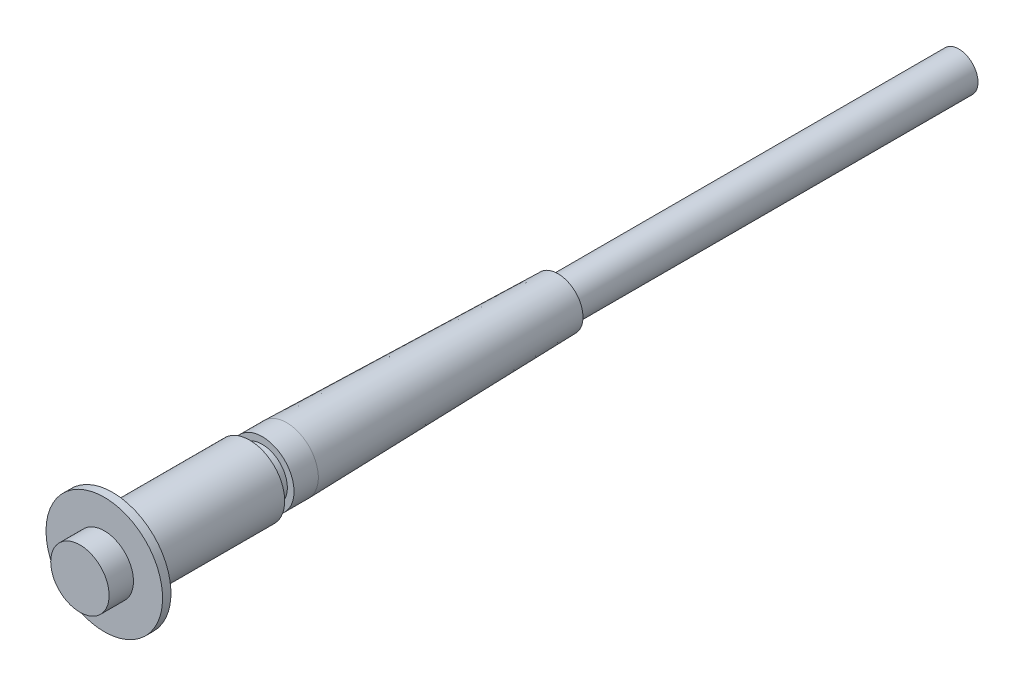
ISO-10303-21;
HEADER;
FILE_DESCRIPTION(('STEP AP214'),'2;1');
FILE_NAME('part.step','',(''),(''),'','','');
FILE_SCHEMA(('AUTOMOTIVE_DESIGN { 1 0 10303 214 1 1 1 1 }'));
ENDSEC;
DATA;
#1=APPLICATION_CONTEXT('core data for automotive mechanical design processes');
#2=APPLICATION_PROTOCOL_DEFINITION('international standard','automotive_design',2000,#1);
#3=PRODUCT_CONTEXT('',#1,'mechanical');
#4=PRODUCT('Part','Part','',(#3));
#5=PRODUCT_RELATED_PRODUCT_CATEGORY('part','',(#4));
#6=PRODUCT_DEFINITION_FORMATION('','',#4);
#7=PRODUCT_DEFINITION_CONTEXT('part definition',#1,'design');
#8=PRODUCT_DEFINITION('design','',#6,#7);
#9=PRODUCT_DEFINITION_SHAPE('','',#8);
#10=(LENGTH_UNIT() NAMED_UNIT(*) SI_UNIT(.MILLI.,.METRE.));
#11=(NAMED_UNIT(*) PLANE_ANGLE_UNIT() SI_UNIT($,.RADIAN.));
#12=(NAMED_UNIT(*) SI_UNIT($,.STERADIAN.) SOLID_ANGLE_UNIT());
#13=UNCERTAINTY_MEASURE_WITH_UNIT(LENGTH_MEASURE(1.E-05),#10,'distance_accuracy_value','');
#14=(GEOMETRIC_REPRESENTATION_CONTEXT(3) GLOBAL_UNCERTAINTY_ASSIGNED_CONTEXT((#13)) GLOBAL_UNIT_ASSIGNED_CONTEXT((#10,
#11,#12)) REPRESENTATION_CONTEXT('',''));
#15=CARTESIAN_POINT('',(0.,0.,0.));
#16=DIRECTION('',(0.,0.,1.));
#17=DIRECTION('',(1.,0.,0.));
#18=AXIS2_PLACEMENT_3D('',#15,#16,#17);
#19=CARTESIAN_POINT('',(-19.05,0.,-344.932));
#20=DIRECTION('',(0.,0.,-1.));
#21=DIRECTION('',(-1.,0.,0.));
#22=AXIS2_PLACEMENT_3D('',#19,#20,#21);
#23=PLANE('',#22);
#24=CARTESIAN_POINT('',(0.,0.,-344.932));
#25=DIRECTION('',(0.,0.,-1.));
#26=DIRECTION('',(-1.,0.,0.));
#27=AXIS2_PLACEMENT_3D('',#24,#25,#26);
#28=CIRCLE('',#27,19.05);
#29=CARTESIAN_POINT('',(-19.05,0.,-344.932));
#30=VERTEX_POINT('',#29);
#31=EDGE_CURVE('E63',#30,#30,#28,.T.);
#32=ORIENTED_EDGE('',*,*,#31,.T.);
#33=EDGE_LOOP('',(#32));
#34=FACE_BOUND('',#33,.T.);
#35=CARTESIAN_POINT('',(0.,0.,-344.932));
#36=DIRECTION('',(0.,0.,-1.));
#37=DIRECTION('',(-1.,0.,0.));
#38=AXIS2_PLACEMENT_3D('',#35,#36,#37);
#39=CIRCLE('',#38,14.605);
#40=CARTESIAN_POINT('',(14.605,0.,-344.932));
#41=VERTEX_POINT('',#40);
#42=EDGE_CURVE('E69',#41,#41,#39,.T.);
#43=ORIENTED_EDGE('',*,*,#42,.F.);
#44=EDGE_LOOP('',(#43));
#45=FACE_BOUND('',#44,.T.);
#46=ADVANCED_FACE('F25',(#34,#45),#23,.T.);
#47=CARTESIAN_POINT('',(0.,0.,18.542));
#48=DIRECTION('',(0.,0.,1.));
#49=DIRECTION('',(1.,0.,0.));
#50=AXIS2_PLACEMENT_3D('',#47,#48,#49);
#51=PLANE('',#50);
#52=CARTESIAN_POINT('',(0.,0.,18.542));
#53=DIRECTION('',(0.,0.,-1.));
#54=DIRECTION('',(-1.,0.,0.));
#55=AXIS2_PLACEMENT_3D('',#52,#53,#54);
#56=CIRCLE('',#55,22.1996);
#57=CARTESIAN_POINT('',(-22.1996,0.,18.542));
#58=VERTEX_POINT('',#57);
#59=EDGE_CURVE('E10',#58,#58,#56,.T.);
#60=ORIENTED_EDGE('',*,*,#59,.F.);
#61=EDGE_LOOP('',(#60));
#62=FACE_BOUND('',#61,.T.);
#63=ADVANCED_FACE('F27',(#62),#51,.T.);
#64=CARTESIAN_POINT('',(0.,0.,-204.828193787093));
#65=DIRECTION('',(0.,0.,-1.));
#66=DIRECTION('',(-1.,0.,0.));
#67=AXIS2_PLACEMENT_3D('',#64,#65,#66);
#68=CYLINDRICAL_SURFACE('',#67,22.1996);
#69=ORIENTED_EDGE('',*,*,#59,.T.);
#70=EDGE_LOOP('',(#69));
#71=FACE_BOUND('',#70,.T.);
#72=CARTESIAN_POINT('',(0.,0.,0.));
#73=DIRECTION('',(0.,0.,-1.));
#74=DIRECTION('',(-1.,0.,0.));
#75=AXIS2_PLACEMENT_3D('',#72,#73,#74);
#76=CIRCLE('',#75,22.1996);
#77=CARTESIAN_POINT('',(-22.1996,0.,0.));
#78=VERTEX_POINT('',#77);
#79=EDGE_CURVE('E32',#78,#78,#76,.T.);
#80=ORIENTED_EDGE('',*,*,#79,.F.);
#81=EDGE_LOOP('',(#80));
#82=FACE_BOUND('',#81,.T.);
#83=ADVANCED_FACE('F83',(#71,#82),#68,.T.);
#84=CARTESIAN_POINT('',(-22.1996,0.,0.));
#85=DIRECTION('',(0.,0.,1.));
#86=DIRECTION('',(1.,0.,0.));
#87=AXIS2_PLACEMENT_3D('',#84,#85,#86);
#88=PLANE('',#87);
#89=ORIENTED_EDGE('',*,*,#79,.T.);
#90=EDGE_LOOP('',(#89));
#91=FACE_BOUND('',#90,.T.);
#92=CARTESIAN_POINT('',(0.,0.,0.));
#93=DIRECTION('',(0.,0.,-1.));
#94=DIRECTION('',(-1.,0.,0.));
#95=AXIS2_PLACEMENT_3D('',#92,#93,#94);
#96=CIRCLE('',#95,44.323);
#97=CARTESIAN_POINT('',(-44.323,0.,0.));
#98=VERTEX_POINT('',#97);
#99=EDGE_CURVE('E36',#98,#98,#96,.T.);
#100=ORIENTED_EDGE('',*,*,#99,.F.);
#101=EDGE_LOOP('',(#100));
#102=FACE_BOUND('',#101,.T.);
#103=ADVANCED_FACE('F118',(#91,#102),#88,.T.);
#104=CARTESIAN_POINT('',(0.,0.,-204.828193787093));
#105=DIRECTION('',(0.,0.,-1.));
#106=DIRECTION('',(-1.,0.,0.));
#107=AXIS2_PLACEMENT_3D('',#104,#105,#106);
#108=CYLINDRICAL_SURFACE('',#107,44.323);
#109=ORIENTED_EDGE('',*,*,#99,.T.);
#110=EDGE_LOOP('',(#109));
#111=FACE_BOUND('',#110,.T.);
#112=CARTESIAN_POINT('',(0.,0.,-6.34999999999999));
#113=DIRECTION('',(0.,0.,-1.));
#114=DIRECTION('',(-1.,0.,0.));
#115=AXIS2_PLACEMENT_3D('',#112,#113,#114);
#116=CIRCLE('',#115,44.323);
#117=CARTESIAN_POINT('',(-44.323,0.,-6.34999999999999));
#118=VERTEX_POINT('',#117);
#119=EDGE_CURVE('E40',#118,#118,#116,.T.);
#120=ORIENTED_EDGE('',*,*,#119,.F.);
#121=EDGE_LOOP('',(#120));
#122=FACE_BOUND('',#121,.T.);
#123=ADVANCED_FACE('F114',(#111,#122),#108,.T.);
#124=CARTESIAN_POINT('',(-44.323,0.,-6.35));
#125=DIRECTION('',(0.,0.,-1.));
#126=DIRECTION('',(-1.,0.,0.));
#127=AXIS2_PLACEMENT_3D('',#124,#125,#126);
#128=PLANE('',#127);
#129=ORIENTED_EDGE('',*,*,#119,.T.);
#130=EDGE_LOOP('',(#129));
#131=FACE_BOUND('',#130,.T.);
#132=CARTESIAN_POINT('',(0.,0.,-6.34999999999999));
#133=DIRECTION('',(0.,0.,-1.));
#134=DIRECTION('',(-1.,0.,0.));
#135=AXIS2_PLACEMENT_3D('',#132,#133,#134);
#136=CIRCLE('',#135,26.67);
#137=CARTESIAN_POINT('',(-26.67,0.,-6.34999999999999));
#138=VERTEX_POINT('',#137);
#139=EDGE_CURVE('E45',#138,#138,#136,.T.);
#140=ORIENTED_EDGE('',*,*,#139,.F.);
#141=EDGE_LOOP('',(#140));
#142=FACE_BOUND('',#141,.T.);
#143=ADVANCED_FACE('F110',(#131,#142),#128,.T.);
#144=CARTESIAN_POINT('',(0.,0.,-204.828193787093));
#145=DIRECTION('',(0.,0.,-1.));
#146=DIRECTION('',(-1.,0.,0.));
#147=AXIS2_PLACEMENT_3D('',#144,#145,#146);
#148=CYLINDRICAL_SURFACE('',#147,26.67);
#149=ORIENTED_EDGE('',*,*,#139,.T.);
#150=EDGE_LOOP('',(#149));
#151=FACE_BOUND('',#150,.T.);
#152=CARTESIAN_POINT('',(0.,0.,-110.49));
#153=DIRECTION('',(0.,0.,-1.));
#154=DIRECTION('',(-1.,0.,0.));
#155=AXIS2_PLACEMENT_3D('',#152,#153,#154);
#156=CIRCLE('',#155,26.67);
#157=CARTESIAN_POINT('',(-26.67,0.,-110.49));
#158=VERTEX_POINT('',#157);
#159=EDGE_CURVE('E48',#158,#158,#156,.T.);
#160=ORIENTED_EDGE('',*,*,#159,.F.);
#161=EDGE_LOOP('',(#160));
#162=FACE_BOUND('',#161,.T.);
#163=ADVANCED_FACE('F106',(#151,#162),#148,.T.);
#164=CARTESIAN_POINT('',(-19.05,0.,-110.49));
#165=DIRECTION('',(0.,0.,-1.));
#166=DIRECTION('',(-1.,0.,0.));
#167=AXIS2_PLACEMENT_3D('',#164,#165,#166);
#168=PLANE('',#167);
#169=ORIENTED_EDGE('',*,*,#159,.T.);
#170=EDGE_LOOP('',(#169));
#171=FACE_BOUND('',#170,.T.);
#172=CARTESIAN_POINT('',(0.,0.,-110.49));
#173=DIRECTION('',(0.,0.,-1.));
#174=DIRECTION('',(-1.,0.,0.));
#175=AXIS2_PLACEMENT_3D('',#172,#173,#174);
#176=CIRCLE('',#175,19.05);
#177=CARTESIAN_POINT('',(-19.05,0.,-110.49));
#178=VERTEX_POINT('',#177);
#179=EDGE_CURVE('E51',#178,#178,#176,.T.);
#180=ORIENTED_EDGE('',*,*,#179,.F.);
#181=EDGE_LOOP('',(#180));
#182=FACE_BOUND('',#181,.T.);
#183=ADVANCED_FACE('F102',(#171,#182),#168,.T.);
#184=CARTESIAN_POINT('',(0.,0.,-204.828193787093));
#185=DIRECTION('',(0.,0.,-1.));
#186=DIRECTION('',(-1.,0.,0.));
#187=AXIS2_PLACEMENT_3D('',#184,#185,#186);
#188=CYLINDRICAL_SURFACE('',#187,19.05);
#189=ORIENTED_EDGE('',*,*,#179,.T.);
#190=EDGE_LOOP('',(#189));
#191=FACE_BOUND('',#190,.T.);
#192=CARTESIAN_POINT('',(0.,0.,-120.142));
#193=DIRECTION('',(0.,0.,-1.));
#194=DIRECTION('',(-1.,0.,0.));
#195=AXIS2_PLACEMENT_3D('',#192,#193,#194);
#196=CIRCLE('',#195,19.05);
#197=CARTESIAN_POINT('',(-19.05,0.,-120.142));
#198=VERTEX_POINT('',#197);
#199=EDGE_CURVE('E54',#198,#198,#196,.T.);
#200=ORIENTED_EDGE('',*,*,#199,.F.);
#201=EDGE_LOOP('',(#200));
#202=FACE_BOUND('',#201,.T.);
#203=ADVANCED_FACE('F98',(#191,#202),#188,.T.);
#204=CARTESIAN_POINT('',(-19.05,0.,-120.142));
#205=DIRECTION('',(0.,0.,1.));
#206=DIRECTION('',(1.,0.,0.));
#207=AXIS2_PLACEMENT_3D('',#204,#205,#206);
#208=PLANE('',#207);
#209=ORIENTED_EDGE('',*,*,#199,.T.);
#210=EDGE_LOOP('',(#209));
#211=FACE_BOUND('',#210,.T.);
#212=CARTESIAN_POINT('',(0.,0.,-120.142));
#213=DIRECTION('',(0.,0.,-1.));
#214=DIRECTION('',(-1.,0.,0.));
#215=AXIS2_PLACEMENT_3D('',#212,#213,#214);
#216=CIRCLE('',#215,24.13);
#217=CARTESIAN_POINT('',(-24.13,0.,-120.142));
#218=VERTEX_POINT('',#217);
#219=EDGE_CURVE('E57',#218,#218,#216,.T.);
#220=ORIENTED_EDGE('',*,*,#219,.F.);
#221=EDGE_LOOP('',(#220));
#222=FACE_BOUND('',#221,.T.);
#223=ADVANCED_FACE('F94',(#211,#222),#208,.T.);
#224=CARTESIAN_POINT('',(0.,0.,-204.828193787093));
#225=DIRECTION('',(0.,0.,-1.));
#226=DIRECTION('',(-1.,0.,0.));
#227=AXIS2_PLACEMENT_3D('',#224,#225,#226);
#228=CYLINDRICAL_SURFACE('',#227,24.13);
#229=ORIENTED_EDGE('',*,*,#219,.T.);
#230=EDGE_LOOP('',(#229));
#231=FACE_BOUND('',#230,.T.);
#232=CARTESIAN_POINT('',(0.,0.,-138.610224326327));
#233=DIRECTION('',(0.,0.,-1.));
#234=DIRECTION('',(-1.,0.,0.));
#235=AXIS2_PLACEMENT_3D('',#232,#233,#234);
#236=CIRCLE('',#235,24.13);
#237=CARTESIAN_POINT('',(-24.13,0.,-138.610224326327));
#238=VERTEX_POINT('',#237);
#239=EDGE_CURVE('E60',#238,#238,#236,.T.);
#240=ORIENTED_EDGE('',*,*,#239,.F.);
#241=EDGE_LOOP('',(#240));
#242=FACE_BOUND('',#241,.T.);
#243=ADVANCED_FACE('F90',(#231,#242),#228,.T.);
#244=CARTESIAN_POINT('',(0.,0.,-344.932));
#245=DIRECTION('',(0.,0.,1.));
#246=DIRECTION('',(1.,0.,0.));
#247=AXIS2_PLACEMENT_3D('',#244,#245,#246);
#248=CONICAL_SURFACE('',#247,19.05,0.0246167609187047);
#249=ORIENTED_EDGE('',*,*,#239,.T.);
#250=EDGE_LOOP('',(#249));
#251=FACE_BOUND('',#250,.T.);
#252=ORIENTED_EDGE('',*,*,#31,.F.);
#253=EDGE_LOOP('',(#252));
#254=FACE_BOUND('',#253,.T.);
#255=ADVANCED_FACE('F88',(#251,#254),#248,.T.);
#256=CARTESIAN_POINT('',(0.,0.,-649.732));
#257=DIRECTION('',(0.,0.,1.));
#258=DIRECTION('',(1.,0.,0.));
#259=AXIS2_PLACEMENT_3D('',#256,#257,#258);
#260=CYLINDRICAL_SURFACE('',#259,14.605);
#261=CARTESIAN_POINT('',(0.,0.,-649.732));
#262=DIRECTION('',(0.,0.,-1.));
#263=DIRECTION('',(-1.,0.,0.));
#264=AXIS2_PLACEMENT_3D('',#261,#262,#263);
#265=CIRCLE('',#264,14.605);
#266=CARTESIAN_POINT('',(14.6049999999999,0.,-649.732));
#267=VERTEX_POINT('',#266);
#268=EDGE_CURVE('E66',#267,#267,#265,.T.);
#269=CARTESIAN_POINT('',(14.6049999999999,0.,-649.732));
#270=CARTESIAN_POINT('',(14.6049999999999,0.,-646.557));
#271=CARTESIAN_POINT('',(14.6049999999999,0.,-643.382));
#272=CARTESIAN_POINT('',(14.6049999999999,0.,-637.032));
#273=CARTESIAN_POINT('',(14.6049999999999,0.,-633.857));
#274=CARTESIAN_POINT('',(14.6049999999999,0.,-627.507));
#275=CARTESIAN_POINT('',(14.6049999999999,0.,-624.332));
#276=CARTESIAN_POINT('',(14.6049999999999,0.,-617.982));
#277=CARTESIAN_POINT('',(14.6049999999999,0.,-614.807));
#278=CARTESIAN_POINT('',(14.6049999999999,0.,-608.457));
#279=CARTESIAN_POINT('',(14.6049999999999,0.,-605.282));
#280=CARTESIAN_POINT('',(14.6049999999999,0.,-598.932));
#281=CARTESIAN_POINT('',(14.6049999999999,0.,-595.757));
#282=CARTESIAN_POINT('',(14.6049999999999,0.,-589.407));
#283=CARTESIAN_POINT('',(14.6049999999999,0.,-586.232));
#284=CARTESIAN_POINT('',(14.6049999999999,0.,-579.882));
#285=CARTESIAN_POINT('',(14.6049999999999,0.,-576.707));
#286=CARTESIAN_POINT('',(14.6049999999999,0.,-570.357));
#287=CARTESIAN_POINT('',(14.6049999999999,0.,-567.182));
#288=CARTESIAN_POINT('',(14.6049999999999,0.,-560.832));
#289=CARTESIAN_POINT('',(14.6049999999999,0.,-557.657));
#290=CARTESIAN_POINT('',(14.6049999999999,0.,-551.307));
#291=CARTESIAN_POINT('',(14.6049999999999,0.,-548.132));
#292=CARTESIAN_POINT('',(14.6049999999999,0.,-541.782));
#293=CARTESIAN_POINT('',(14.6049999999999,0.,-538.607));
#294=CARTESIAN_POINT('',(14.6049999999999,0.,-532.257));
#295=CARTESIAN_POINT('',(14.6049999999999,0.,-529.082));
#296=CARTESIAN_POINT('',(14.6049999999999,0.,-522.732));
#297=CARTESIAN_POINT('',(14.6049999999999,0.,-519.557));
#298=CARTESIAN_POINT('',(14.6049999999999,0.,-513.207));
#299=CARTESIAN_POINT('',(14.6049999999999,0.,-510.032));
#300=CARTESIAN_POINT('',(14.6049999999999,0.,-503.682));
#301=CARTESIAN_POINT('',(14.6049999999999,0.,-500.507));
#302=CARTESIAN_POINT('',(14.6049999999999,0.,-494.157));
#303=CARTESIAN_POINT('',(14.6049999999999,0.,-490.982));
#304=CARTESIAN_POINT('',(14.6049999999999,0.,-484.632));
#305=CARTESIAN_POINT('',(14.605,0.,-481.457));
#306=CARTESIAN_POINT('',(14.605,0.,-475.107));
#307=CARTESIAN_POINT('',(14.605,0.,-471.932));
#308=CARTESIAN_POINT('',(14.605,0.,-465.582));
#309=CARTESIAN_POINT('',(14.605,0.,-462.407));
#310=CARTESIAN_POINT('',(14.605,0.,-456.057));
#311=CARTESIAN_POINT('',(14.605,0.,-452.882));
#312=CARTESIAN_POINT('',(14.605,0.,-446.532));
#313=CARTESIAN_POINT('',(14.605,0.,-443.357));
#314=CARTESIAN_POINT('',(14.605,0.,-437.007));
#315=CARTESIAN_POINT('',(14.605,0.,-433.832));
#316=CARTESIAN_POINT('',(14.605,0.,-427.482));
#317=CARTESIAN_POINT('',(14.605,0.,-424.307));
#318=CARTESIAN_POINT('',(14.605,0.,-417.957));
#319=CARTESIAN_POINT('',(14.605,0.,-414.782));
#320=CARTESIAN_POINT('',(14.605,0.,-408.432));
#321=CARTESIAN_POINT('',(14.605,0.,-405.257));
#322=CARTESIAN_POINT('',(14.605,0.,-398.907));
#323=CARTESIAN_POINT('',(14.605,0.,-395.732));
#324=CARTESIAN_POINT('',(14.605,0.,-389.382));
#325=CARTESIAN_POINT('',(14.605,0.,-386.207));
#326=CARTESIAN_POINT('',(14.605,0.,-379.857));
#327=CARTESIAN_POINT('',(14.605,0.,-376.682));
#328=CARTESIAN_POINT('',(14.605,0.,-370.332));
#329=CARTESIAN_POINT('',(14.605,0.,-367.157));
#330=CARTESIAN_POINT('',(14.605,0.,-360.807));
#331=CARTESIAN_POINT('',(14.605,0.,-357.632));
#332=CARTESIAN_POINT('',(14.605,0.,-351.282));
#333=CARTESIAN_POINT('',(14.605,0.,-348.107));
#334=CARTESIAN_POINT('',(14.605,0.,-344.932));
#335=B_SPLINE_CURVE_WITH_KNOTS('',3,(#269,#270,#271,#272,#273,#274,#275,#276,#277,#278,#279,
#280,#281,#282,#283,#284,#285,#286,#287,#288,#289,#290,#291,#292,#293,#294,#295,#296,#297,#298,
#299,#300,#301,#302,#303,#304,#305,#306,#307,#308,#309,#310,#311,#312,#313,#314,#315,#316,#317,
#318,#319,#320,#321,#322,#323,#324,#325,#326,#327,#328,#329,#330,#331,#332,#333,#334),
.UNSPECIFIED.,.F.,.F.,(4,2,2,2,2,2,2,2,2,2,2,2,2,2,2,2,2,2,2,2,2,2,2,2,2,2,2,2,2,2,2,2,4),(0.,
9.5249999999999,19.0499999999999,28.5749999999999,38.0999999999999,47.6249999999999,
57.1499999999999,66.6749999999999,76.1999999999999,85.7249999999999,95.2499999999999,104.775,
114.3,123.825,133.35,142.875,152.4,161.925,171.45,180.975,190.5,200.025,209.55,219.075,228.6,
238.125,247.65,257.175,266.7,276.225,285.75,295.275,304.8),.UNSPECIFIED.);
#336=EDGE_CURVE('BSEAM73',#267,#41,#335,.T.);
#337=ORIENTED_EDGE('',*,*,#268,.F.);
#338=ORIENTED_EDGE('',*,*,#42,.T.);
#339=ORIENTED_EDGE('',*,*,#336,.T.);
#340=ORIENTED_EDGE('',*,*,#336,.F.);
#341=EDGE_LOOP('',(#337,#339,#338,#340));
#342=FACE_BOUND('',#341,.T.);
#343=ADVANCED_FACE('F73',(#342),#260,.T.);
#344=CARTESIAN_POINT('',(0.,0.,-649.732));
#345=DIRECTION('',(0.,0.,-1.));
#346=DIRECTION('',(-1.,0.,0.));
#347=AXIS2_PLACEMENT_3D('',#344,#345,#346);
#348=PLANE('',#347);
#349=ORIENTED_EDGE('',*,*,#268,.T.);
#350=EDGE_LOOP('',(#349));
#351=FACE_BOUND('',#350,.T.);
#352=ADVANCED_FACE('F171',(#351),#348,.T.);
#353=CLOSED_SHELL('',(#46,#63,#83,#103,#123,#143,#163,#183,#203,#223,#243,#255,#343,#352));
#354=MANIFOLD_SOLID_BREP('B2',#353);
#355=ADVANCED_BREP_SHAPE_REPRESENTATION('',(#18,#354),#14);
#356=SHAPE_DEFINITION_REPRESENTATION(#9,#355);
ENDSEC;
END-ISO-10303-21;
